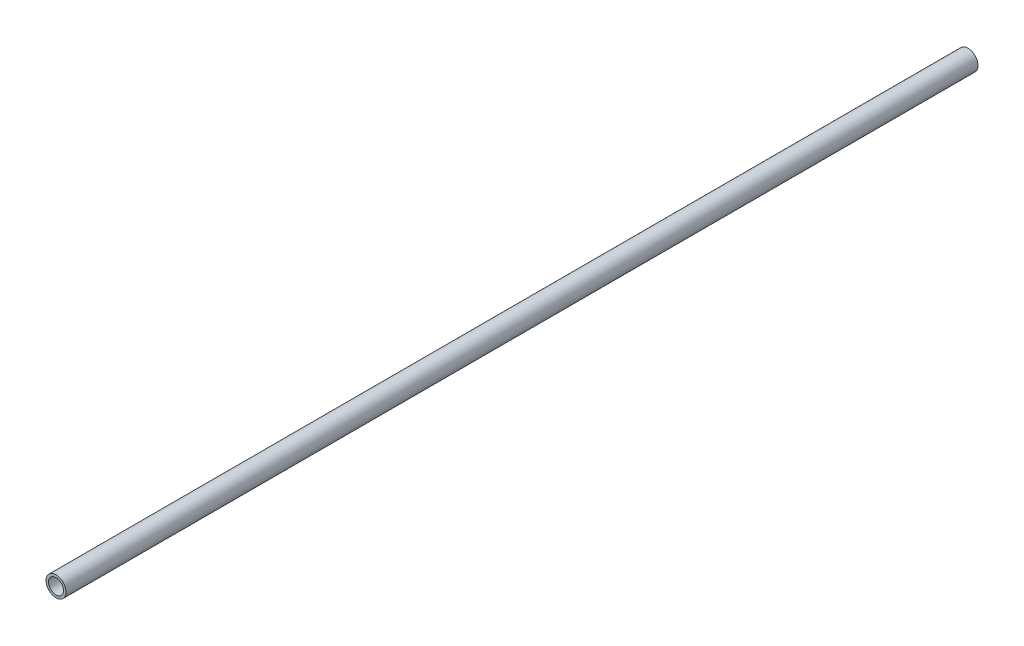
ISO-10303-21;
HEADER;
FILE_DESCRIPTION(('STEP AP214'),'2;1');
FILE_NAME('part.step','',(''),(''),'','','');
FILE_SCHEMA(('AUTOMOTIVE_DESIGN { 1 0 10303 214 1 1 1 1 }'));
ENDSEC;
DATA;
#1=APPLICATION_CONTEXT('core data for automotive mechanical design processes');
#2=APPLICATION_PROTOCOL_DEFINITION('international standard','automotive_design',2000,#1);
#3=PRODUCT_CONTEXT('',#1,'mechanical');
#4=PRODUCT('Part','Part','',(#3));
#5=PRODUCT_RELATED_PRODUCT_CATEGORY('part','',(#4));
#6=PRODUCT_DEFINITION_FORMATION('','',#4);
#7=PRODUCT_DEFINITION_CONTEXT('part definition',#1,'design');
#8=PRODUCT_DEFINITION('design','',#6,#7);
#9=PRODUCT_DEFINITION_SHAPE('','',#8);
#10=(LENGTH_UNIT() NAMED_UNIT(*) SI_UNIT(.MILLI.,.METRE.));
#11=(NAMED_UNIT(*) PLANE_ANGLE_UNIT() SI_UNIT($,.RADIAN.));
#12=(NAMED_UNIT(*) SI_UNIT($,.STERADIAN.) SOLID_ANGLE_UNIT());
#13=UNCERTAINTY_MEASURE_WITH_UNIT(LENGTH_MEASURE(1.E-05),#10,'distance_accuracy_value','');
#14=(GEOMETRIC_REPRESENTATION_CONTEXT(3) GLOBAL_UNCERTAINTY_ASSIGNED_CONTEXT((#13)) GLOBAL_UNIT_ASSIGNED_CONTEXT((#10,
#11,#12)) REPRESENTATION_CONTEXT('',''));
#15=CARTESIAN_POINT('',(0.,0.,0.));
#16=DIRECTION('',(0.,0.,1.));
#17=DIRECTION('',(1.,0.,0.));
#18=AXIS2_PLACEMENT_3D('',#15,#16,#17);
#19=CARTESIAN_POINT('',(0.,0.,365.));
#20=DIRECTION('',(0.,0.,1.));
#21=DIRECTION('',(1.,0.,0.));
#22=AXIS2_PLACEMENT_3D('',#19,#20,#21);
#23=PLANE('',#22);
#24=CARTESIAN_POINT('',(0.,0.,365.));
#25=DIRECTION('',(0.,0.,1.));
#26=DIRECTION('',(1.,0.,0.));
#27=AXIS2_PLACEMENT_3D('',#24,#25,#26);
#28=CIRCLE('',#27,4.);
#29=CARTESIAN_POINT('',(-4.,0.,365.));
#30=VERTEX_POINT('',#29);
#31=EDGE_CURVE('E10',#30,#30,#28,.T.);
#32=ORIENTED_EDGE('',*,*,#31,.T.);
#33=EDGE_LOOP('',(#32));
#34=FACE_BOUND('',#33,.T.);
#35=CARTESIAN_POINT('',(0.,0.,365.));
#36=DIRECTION('',(0.,0.,1.));
#37=DIRECTION('',(1.,0.,0.));
#38=AXIS2_PLACEMENT_3D('',#35,#36,#37);
#39=CIRCLE('',#38,3.);
#40=CARTESIAN_POINT('',(-3.,0.,365.));
#41=VERTEX_POINT('',#40);
#42=EDGE_CURVE('E37',#41,#41,#39,.T.);
#43=ORIENTED_EDGE('',*,*,#42,.F.);
#44=EDGE_LOOP('',(#43));
#45=FACE_BOUND('',#44,.T.);
#46=ADVANCED_FACE('F26',(#34,#45),#23,.T.);
#47=CARTESIAN_POINT('',(0.,0.,0.));
#48=DIRECTION('',(0.,0.,1.));
#49=DIRECTION('',(1.,0.,0.));
#50=AXIS2_PLACEMENT_3D('',#47,#48,#49);
#51=PLANE('',#50);
#52=CARTESIAN_POINT('',(0.,0.,0.));
#53=DIRECTION('',(0.,0.,1.));
#54=DIRECTION('',(1.,0.,0.));
#55=AXIS2_PLACEMENT_3D('',#52,#53,#54);
#56=CIRCLE('',#55,4.);
#57=CARTESIAN_POINT('',(-4.,0.,0.));
#58=VERTEX_POINT('',#57);
#59=EDGE_CURVE('E33',#58,#58,#56,.T.);
#60=ORIENTED_EDGE('',*,*,#59,.F.);
#61=EDGE_LOOP('',(#60));
#62=FACE_BOUND('',#61,.T.);
#63=CARTESIAN_POINT('',(0.,0.,0.));
#64=DIRECTION('',(0.,0.,1.));
#65=DIRECTION('',(1.,0.,0.));
#66=AXIS2_PLACEMENT_3D('',#63,#64,#65);
#67=CIRCLE('',#66,3.);
#68=CARTESIAN_POINT('',(-3.,0.,0.));
#69=VERTEX_POINT('',#68);
#70=EDGE_CURVE('E41',#69,#69,#67,.T.);
#71=ORIENTED_EDGE('',*,*,#70,.T.);
#72=EDGE_LOOP('',(#71));
#73=FACE_BOUND('',#72,.T.);
#74=ADVANCED_FACE('F47',(#62,#73),#51,.F.);
#75=CARTESIAN_POINT('',(0.,0.,365.));
#76=DIRECTION('',(0.,0.,-1.));
#77=DIRECTION('',(-1.,0.,0.));
#78=AXIS2_PLACEMENT_3D('',#75,#76,#77);
#79=CYLINDRICAL_SURFACE('',#78,4.);
#80=CARTESIAN_POINT('',(-4.,0.,365.));
#81=CARTESIAN_POINT('',(-4.,0.,361.197916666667));
#82=CARTESIAN_POINT('',(-4.,0.,357.395833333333));
#83=CARTESIAN_POINT('',(-4.,0.,349.791666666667));
#84=CARTESIAN_POINT('',(-4.,0.,345.989583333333));
#85=CARTESIAN_POINT('',(-4.,0.,338.385416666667));
#86=CARTESIAN_POINT('',(-4.,0.,334.583333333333));
#87=CARTESIAN_POINT('',(-4.,0.,326.979166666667));
#88=CARTESIAN_POINT('',(-4.,0.,323.177083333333));
#89=CARTESIAN_POINT('',(-4.,0.,315.572916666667));
#90=CARTESIAN_POINT('',(-4.,0.,311.770833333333));
#91=CARTESIAN_POINT('',(-4.,0.,304.166666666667));
#92=CARTESIAN_POINT('',(-4.,0.,300.364583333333));
#93=CARTESIAN_POINT('',(-4.,0.,292.760416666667));
#94=CARTESIAN_POINT('',(-4.,0.,288.958333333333));
#95=CARTESIAN_POINT('',(-4.,0.,281.354166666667));
#96=CARTESIAN_POINT('',(-4.,0.,277.552083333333));
#97=CARTESIAN_POINT('',(-4.,0.,269.947916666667));
#98=CARTESIAN_POINT('',(-4.,0.,266.145833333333));
#99=CARTESIAN_POINT('',(-4.,0.,258.541666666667));
#100=CARTESIAN_POINT('',(-4.,0.,254.739583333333));
#101=CARTESIAN_POINT('',(-4.,0.,247.135416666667));
#102=CARTESIAN_POINT('',(-4.,0.,243.333333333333));
#103=CARTESIAN_POINT('',(-4.,0.,235.729166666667));
#104=CARTESIAN_POINT('',(-4.,0.,231.927083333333));
#105=CARTESIAN_POINT('',(-4.,0.,224.322916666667));
#106=CARTESIAN_POINT('',(-4.,0.,220.520833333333));
#107=CARTESIAN_POINT('',(-4.,0.,212.916666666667));
#108=CARTESIAN_POINT('',(-4.,0.,209.114583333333));
#109=CARTESIAN_POINT('',(-4.,0.,201.510416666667));
#110=CARTESIAN_POINT('',(-4.,0.,197.708333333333));
#111=CARTESIAN_POINT('',(-4.,0.,190.104166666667));
#112=CARTESIAN_POINT('',(-4.,0.,186.302083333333));
#113=CARTESIAN_POINT('',(-4.,0.,178.697916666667));
#114=CARTESIAN_POINT('',(-4.,0.,174.895833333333));
#115=CARTESIAN_POINT('',(-4.,0.,167.291666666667));
#116=CARTESIAN_POINT('',(-4.,0.,163.489583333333));
#117=CARTESIAN_POINT('',(-4.,0.,155.885416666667));
#118=CARTESIAN_POINT('',(-4.,0.,152.083333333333));
#119=CARTESIAN_POINT('',(-4.,0.,144.479166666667));
#120=CARTESIAN_POINT('',(-4.,0.,140.677083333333));
#121=CARTESIAN_POINT('',(-4.,0.,133.072916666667));
#122=CARTESIAN_POINT('',(-4.,0.,129.270833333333));
#123=CARTESIAN_POINT('',(-4.,0.,121.666666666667));
#124=CARTESIAN_POINT('',(-4.,0.,117.864583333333));
#125=CARTESIAN_POINT('',(-4.,0.,110.260416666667));
#126=CARTESIAN_POINT('',(-4.,0.,106.458333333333));
#127=CARTESIAN_POINT('',(-4.,0.,98.8541666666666));
#128=CARTESIAN_POINT('',(-4.,0.,95.0520833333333));
#129=CARTESIAN_POINT('',(-4.,0.,87.4479166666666));
#130=CARTESIAN_POINT('',(-4.,0.,83.6458333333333));
#131=CARTESIAN_POINT('',(-4.,0.,76.0416666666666));
#132=CARTESIAN_POINT('',(-4.,0.,72.2395833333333));
#133=CARTESIAN_POINT('',(-4.,0.,64.6354166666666));
#134=CARTESIAN_POINT('',(-4.,0.,60.8333333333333));
#135=CARTESIAN_POINT('',(-4.,0.,53.2291666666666));
#136=CARTESIAN_POINT('',(-4.,0.,49.4270833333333));
#137=CARTESIAN_POINT('',(-4.,0.,41.8229166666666));
#138=CARTESIAN_POINT('',(-4.,0.,38.0208333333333));
#139=CARTESIAN_POINT('',(-4.,0.,30.4166666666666));
#140=CARTESIAN_POINT('',(-4.,0.,26.6145833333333));
#141=CARTESIAN_POINT('',(-4.,0.,19.0104166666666));
#142=CARTESIAN_POINT('',(-4.,0.,15.2083333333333));
#143=CARTESIAN_POINT('',(-4.,0.,7.60416666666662));
#144=CARTESIAN_POINT('',(-4.,0.,3.80208333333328));
#145=CARTESIAN_POINT('',(-4.,0.,0.));
#146=B_SPLINE_CURVE_WITH_KNOTS('',3,(#80,#81,#82,#83,#84,#85,#86,#87,#88,#89,#90,#91,#92,#93,
#94,#95,#96,#97,#98,#99,#100,#101,#102,#103,#104,#105,#106,#107,#108,#109,#110,#111,#112,#113,
#114,#115,#116,#117,#118,#119,#120,#121,#122,#123,#124,#125,#126,#127,#128,#129,#130,#131,#132,
#133,#134,#135,#136,#137,#138,#139,#140,#141,#142,#143,#144,#145),.UNSPECIFIED.,.F.,.F.,(4,2,2,
2,2,2,2,2,2,2,2,2,2,2,2,2,2,2,2,2,2,2,2,2,2,2,2,2,2,2,2,2,4),(0.,11.40625,22.8125,34.21875,
45.625,57.03125,68.4375,79.8437499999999,91.25,102.65625,114.0625,125.46875,136.875,148.28125,
159.6875,171.09375,182.5,193.90625,205.3125,216.71875,228.125,239.53125,250.9375,262.34375,
273.75,285.15625,296.5625,307.96875,319.375,330.78125,342.1875,353.59375,365.),.UNSPECIFIED.);
#147=EDGE_CURVE('BSEAM28',#30,#58,#146,.T.);
#148=ORIENTED_EDGE('',*,*,#31,.F.);
#149=ORIENTED_EDGE('',*,*,#59,.T.);
#150=ORIENTED_EDGE('',*,*,#147,.T.);
#151=ORIENTED_EDGE('',*,*,#147,.F.);
#152=EDGE_LOOP('',(#148,#150,#149,#151));
#153=FACE_BOUND('',#152,.T.);
#154=ADVANCED_FACE('F28',(#153),#79,.T.);
#155=CARTESIAN_POINT('',(0.,0.,365.));
#156=DIRECTION('',(0.,0.,-1.));
#157=DIRECTION('',(-1.,0.,0.));
#158=AXIS2_PLACEMENT_3D('',#155,#156,#157);
#159=CYLINDRICAL_SURFACE('',#158,3.);
#160=CARTESIAN_POINT('',(-3.,0.,365.));
#161=CARTESIAN_POINT('',(-3.,0.,361.197916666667));
#162=CARTESIAN_POINT('',(-3.,0.,357.395833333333));
#163=CARTESIAN_POINT('',(-3.,0.,349.791666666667));
#164=CARTESIAN_POINT('',(-3.,0.,345.989583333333));
#165=CARTESIAN_POINT('',(-3.,0.,338.385416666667));
#166=CARTESIAN_POINT('',(-3.,0.,334.583333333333));
#167=CARTESIAN_POINT('',(-3.,0.,326.979166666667));
#168=CARTESIAN_POINT('',(-3.,0.,323.177083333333));
#169=CARTESIAN_POINT('',(-3.,0.,315.572916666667));
#170=CARTESIAN_POINT('',(-3.,0.,311.770833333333));
#171=CARTESIAN_POINT('',(-3.,0.,304.166666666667));
#172=CARTESIAN_POINT('',(-3.,0.,300.364583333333));
#173=CARTESIAN_POINT('',(-3.,0.,292.760416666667));
#174=CARTESIAN_POINT('',(-3.,0.,288.958333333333));
#175=CARTESIAN_POINT('',(-3.,0.,281.354166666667));
#176=CARTESIAN_POINT('',(-3.,0.,277.552083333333));
#177=CARTESIAN_POINT('',(-3.,0.,269.947916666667));
#178=CARTESIAN_POINT('',(-3.,0.,266.145833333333));
#179=CARTESIAN_POINT('',(-3.,0.,258.541666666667));
#180=CARTESIAN_POINT('',(-3.,0.,254.739583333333));
#181=CARTESIAN_POINT('',(-3.,0.,247.135416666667));
#182=CARTESIAN_POINT('',(-3.,0.,243.333333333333));
#183=CARTESIAN_POINT('',(-3.,0.,235.729166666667));
#184=CARTESIAN_POINT('',(-3.,0.,231.927083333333));
#185=CARTESIAN_POINT('',(-3.,0.,224.322916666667));
#186=CARTESIAN_POINT('',(-3.,0.,220.520833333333));
#187=CARTESIAN_POINT('',(-3.,0.,212.916666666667));
#188=CARTESIAN_POINT('',(-3.,0.,209.114583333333));
#189=CARTESIAN_POINT('',(-3.,0.,201.510416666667));
#190=CARTESIAN_POINT('',(-3.,0.,197.708333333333));
#191=CARTESIAN_POINT('',(-3.,0.,190.104166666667));
#192=CARTESIAN_POINT('',(-3.,0.,186.302083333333));
#193=CARTESIAN_POINT('',(-3.,0.,178.697916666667));
#194=CARTESIAN_POINT('',(-3.,0.,174.895833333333));
#195=CARTESIAN_POINT('',(-3.,0.,167.291666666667));
#196=CARTESIAN_POINT('',(-3.,0.,163.489583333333));
#197=CARTESIAN_POINT('',(-3.,0.,155.885416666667));
#198=CARTESIAN_POINT('',(-3.,0.,152.083333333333));
#199=CARTESIAN_POINT('',(-3.,0.,144.479166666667));
#200=CARTESIAN_POINT('',(-3.,0.,140.677083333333));
#201=CARTESIAN_POINT('',(-3.,0.,133.072916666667));
#202=CARTESIAN_POINT('',(-3.,0.,129.270833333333));
#203=CARTESIAN_POINT('',(-3.,0.,121.666666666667));
#204=CARTESIAN_POINT('',(-3.,0.,117.864583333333));
#205=CARTESIAN_POINT('',(-3.,0.,110.260416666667));
#206=CARTESIAN_POINT('',(-3.,0.,106.458333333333));
#207=CARTESIAN_POINT('',(-3.,0.,98.8541666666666));
#208=CARTESIAN_POINT('',(-3.,0.,95.0520833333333));
#209=CARTESIAN_POINT('',(-3.,0.,87.4479166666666));
#210=CARTESIAN_POINT('',(-3.,0.,83.6458333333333));
#211=CARTESIAN_POINT('',(-3.,0.,76.0416666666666));
#212=CARTESIAN_POINT('',(-3.,0.,72.2395833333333));
#213=CARTESIAN_POINT('',(-3.,0.,64.6354166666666));
#214=CARTESIAN_POINT('',(-3.,0.,60.8333333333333));
#215=CARTESIAN_POINT('',(-3.,0.,53.2291666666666));
#216=CARTESIAN_POINT('',(-3.,0.,49.4270833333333));
#217=CARTESIAN_POINT('',(-3.,0.,41.8229166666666));
#218=CARTESIAN_POINT('',(-3.,0.,38.0208333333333));
#219=CARTESIAN_POINT('',(-3.,0.,30.4166666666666));
#220=CARTESIAN_POINT('',(-3.,0.,26.6145833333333));
#221=CARTESIAN_POINT('',(-3.,0.,19.0104166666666));
#222=CARTESIAN_POINT('',(-3.,0.,15.2083333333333));
#223=CARTESIAN_POINT('',(-3.,0.,7.60416666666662));
#224=CARTESIAN_POINT('',(-3.,0.,3.80208333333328));
#225=CARTESIAN_POINT('',(-3.,0.,0.));
#226=B_SPLINE_CURVE_WITH_KNOTS('',3,(#160,#161,#162,#163,#164,#165,#166,#167,#168,#169,#170,
#171,#172,#173,#174,#175,#176,#177,#178,#179,#180,#181,#182,#183,#184,#185,#186,#187,#188,#189,
#190,#191,#192,#193,#194,#195,#196,#197,#198,#199,#200,#201,#202,#203,#204,#205,#206,#207,#208,
#209,#210,#211,#212,#213,#214,#215,#216,#217,#218,#219,#220,#221,#222,#223,#224,#225),
.UNSPECIFIED.,.F.,.F.,(4,2,2,2,2,2,2,2,2,2,2,2,2,2,2,2,2,2,2,2,2,2,2,2,2,2,2,2,2,2,2,2,4),(0.,
11.40625,22.8125,34.21875,45.625,57.03125,68.4375,79.8437499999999,91.25,102.65625,114.0625,
125.46875,136.875,148.28125,159.6875,171.09375,182.5,193.90625,205.3125,216.71875,228.125,
239.53125,250.9375,262.34375,273.75,285.15625,296.5625,307.96875,319.375,330.78125,342.1875,
353.59375,365.),.UNSPECIFIED.);
#227=EDGE_CURVE('BSEAM49',#41,#69,#226,.T.);
#228=ORIENTED_EDGE('',*,*,#42,.T.);
#229=ORIENTED_EDGE('',*,*,#70,.F.);
#230=ORIENTED_EDGE('',*,*,#227,.T.);
#231=ORIENTED_EDGE('',*,*,#227,.F.);
#232=EDGE_LOOP('',(#228,#230,#229,#231));
#233=FACE_BOUND('',#232,.T.);
#234=ADVANCED_FACE('F49',(#233),#159,.F.);
#235=CLOSED_SHELL('',(#46,#74,#154,#234));
#236=MANIFOLD_SOLID_BREP('B2',#235);
#237=ADVANCED_BREP_SHAPE_REPRESENTATION('',(#18,#236),#14);
#238=SHAPE_DEFINITION_REPRESENTATION(#9,#237);
ENDSEC;
END-ISO-10303-21;
